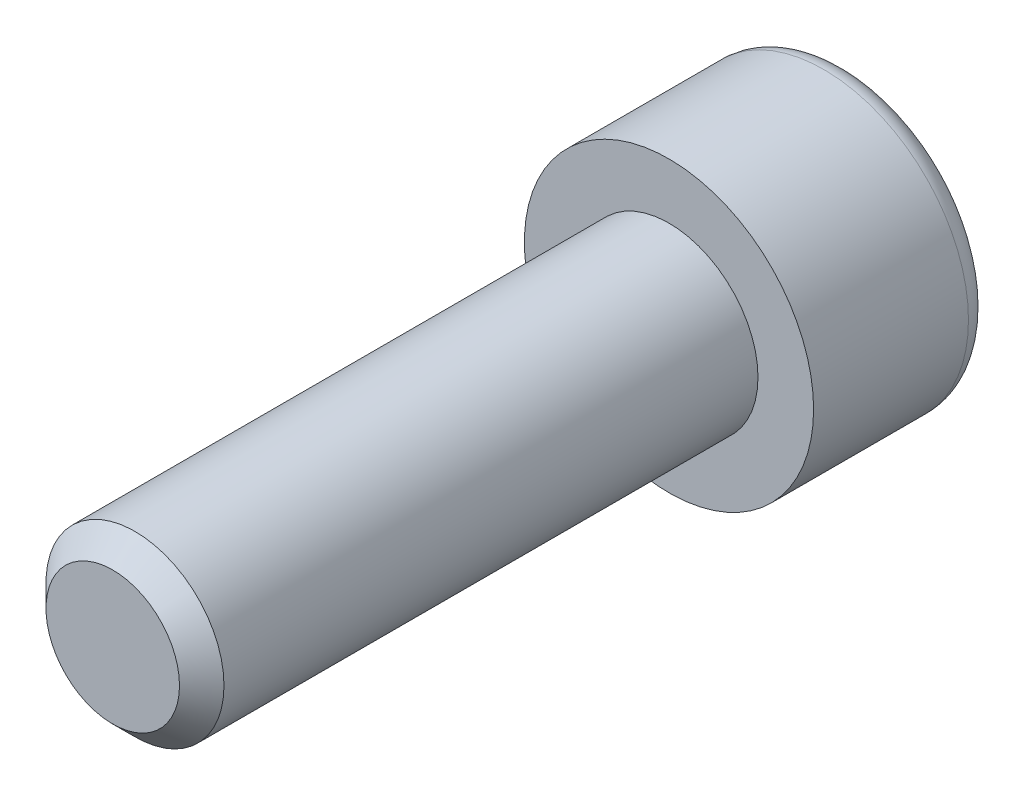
from build123d import *

# Parameters (mm, degrees)
ESQUISSE1_R     = 4
CORPS_DEPTH     = 25
ESQUISSE2_R     = 6.5
TETE_DEPTH      = 8
F_6PANS_DEPTH   = 5.6
CHANFREIN2_SIZE = 1
CONG_1_R        = 1.04


with BuildPart() as part:
    # Esquisse1 → Corps (new body)
    with BuildSketch(Plane.XY):
        Circle(ESQUISSE1_R)
    extrude(amount=CORPS_DEPTH)

    # Esquisse2 → Tete (add)
    with BuildSketch(Plane.XY):
        Circle(ESQUISSE2_R)
    extrude(amount=-TETE_DEPTH)

    # Esquisse3 → 6pans (cut)
    with BuildSketch(Plane.XY.offset(-8)):
        Polygon((0, -3.464101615), (3, -1.732050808), (3, 1.732050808), (0, 3.464101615), (-3, 1.732050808), (-3, -1.732050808), align=None)
    extrude(amount=F_6PANS_DEPTH, mode=Mode.SUBTRACT)

    # Chanfrein2
    chanfrein2_edges = [part.edges().sort_by_distance(p)[0] for p in [
        (-4, 0, 25),
    ]]
    chamfer(chanfrein2_edges, length=CHANFREIN2_SIZE)

    # Cong_1
    cong_1_edges = [part.edges().sort_by_distance(p)[0] for p in [
        (-6.5, 0, -8),
    ]]
    fillet(cong_1_edges, radius=CONG_1_R)


solid = part.part
